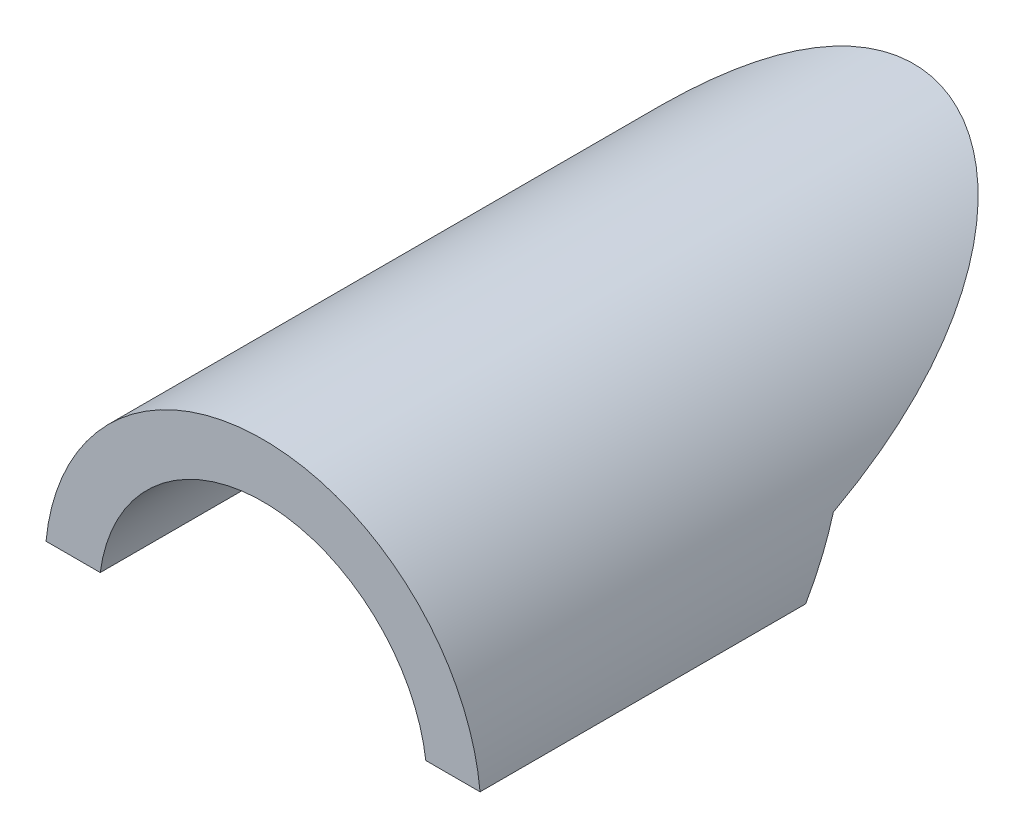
ISO-10303-21;
HEADER;
FILE_DESCRIPTION(('STEP AP214'),'2;1');
FILE_NAME('part.step','',(''),(''),'','','');
FILE_SCHEMA(('AUTOMOTIVE_DESIGN { 1 0 10303 214 1 1 1 1 }'));
ENDSEC;
DATA;
#1=APPLICATION_CONTEXT('core data for automotive mechanical design processes');
#2=APPLICATION_PROTOCOL_DEFINITION('international standard','automotive_design',2000,#1);
#3=PRODUCT_CONTEXT('',#1,'mechanical');
#4=PRODUCT('Part','Part','',(#3));
#5=PRODUCT_RELATED_PRODUCT_CATEGORY('part','',(#4));
#6=PRODUCT_DEFINITION_FORMATION('','',#4);
#7=PRODUCT_DEFINITION_CONTEXT('part definition',#1,'design');
#8=PRODUCT_DEFINITION('design','',#6,#7);
#9=PRODUCT_DEFINITION_SHAPE('','',#8);
#10=(LENGTH_UNIT() NAMED_UNIT(*) SI_UNIT(.MILLI.,.METRE.));
#11=(NAMED_UNIT(*) PLANE_ANGLE_UNIT() SI_UNIT($,.RADIAN.));
#12=(NAMED_UNIT(*) SI_UNIT($,.STERADIAN.) SOLID_ANGLE_UNIT());
#13=UNCERTAINTY_MEASURE_WITH_UNIT(LENGTH_MEASURE(1.E-05),#10,'distance_accuracy_value','');
#14=(GEOMETRIC_REPRESENTATION_CONTEXT(3) GLOBAL_UNCERTAINTY_ASSIGNED_CONTEXT((#13)) GLOBAL_UNIT_ASSIGNED_CONTEXT((#10,
#11,#12)) REPRESENTATION_CONTEXT('',''));
#15=CARTESIAN_POINT('',(0.,0.,0.));
#16=DIRECTION('',(0.,0.,1.));
#17=DIRECTION('',(1.,0.,0.));
#18=AXIS2_PLACEMENT_3D('',#15,#16,#17);
#19=CARTESIAN_POINT('',(101.6,-9.987425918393,304.8));
#20=DIRECTION('',(0.,0.,-1.));
#21=DIRECTION('',(-1.,0.,0.));
#22=AXIS2_PLACEMENT_3D('',#19,#20,#21);
#23=CYLINDRICAL_SURFACE('',#22,102.089708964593);
#24=CARTESIAN_POINT('',(197.497788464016,25.0257550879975,133.720245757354));
#25=CARTESIAN_POINT('',(197.293096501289,25.5863569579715,132.085642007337));
#26=CARTESIAN_POINT('',(197.080174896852,26.1542991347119,130.454575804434));
#27=CARTESIAN_POINT('',(196.636782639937,27.3046532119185,127.199914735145));
#28=CARTESIAN_POINT('',(196.406311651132,27.8870653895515,125.576320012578));
#29=CARTESIAN_POINT('',(195.926687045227,29.0662538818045,122.336712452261));
#30=CARTESIAN_POINT('',(195.677529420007,29.6630332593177,120.720701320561));
#31=CARTESIAN_POINT('',(195.159418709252,30.870564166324,117.497116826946));
#32=CARTESIAN_POINT('',(194.89046571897,31.481315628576,115.889543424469));
#33=CARTESIAN_POINT('',(194.049817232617,33.3391770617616,111.06707017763));
#34=CARTESIAN_POINT('',(193.446266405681,34.6070852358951,107.865626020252));
#35=CARTESIAN_POINT('',(192.143919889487,37.1952640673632,101.503633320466));
#36=CARTESIAN_POINT('',(191.445130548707,38.5155312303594,98.3430820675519));
#37=CARTESIAN_POINT('',(190.312148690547,40.5404898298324,93.6184673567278));
#38=CARTESIAN_POINT('',(189.917771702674,41.2270884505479,92.037015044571));
#39=CARTESIAN_POINT('',(189.09992919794,42.6121760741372,88.8869058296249));
#40=CARTESIAN_POINT('',(188.676464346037,43.3106648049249,87.3182486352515));
#41=CARTESIAN_POINT('',(187.798646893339,44.7189764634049,84.194477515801));
#42=CARTESIAN_POINT('',(187.34429062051,45.4288007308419,82.6393652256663));
#43=CARTESIAN_POINT('',(186.402900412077,46.8589428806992,79.5439708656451));
#44=CARTESIAN_POINT('',(185.915867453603,47.5792604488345,78.0036883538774));
#45=CARTESIAN_POINT('',(184.908020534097,49.0283344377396,74.9416857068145));
#46=CARTESIAN_POINT('',(184.387265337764,49.7570744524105,73.4199384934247));
#47=CARTESIAN_POINT('',(183.309182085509,51.2232451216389,70.393632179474));
#48=CARTESIAN_POINT('',(182.751853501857,51.9606759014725,68.8890733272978));
#49=CARTESIAN_POINT('',(181.598594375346,53.4429706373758,65.8989331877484));
#50=CARTESIAN_POINT('',(181.002671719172,54.1878330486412,64.4133480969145));
#51=CARTESIAN_POINT('',(179.769886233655,55.6838540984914,61.4625466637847));
#52=CARTESIAN_POINT('',(179.13302557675,56.4350124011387,59.9973292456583));
#53=CARTESIAN_POINT('',(177.92678877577,57.8153965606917,57.333758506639));
#54=CARTESIAN_POINT('',(177.364090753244,58.4438700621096,56.131989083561));
#55=CARTESIAN_POINT('',(176.207307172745,59.7032437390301,53.7449925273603));
#56=CARTESIAN_POINT('',(175.613222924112,60.334143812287,52.559764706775));
#57=CARTESIAN_POINT('',(174.392117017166,61.5974061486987,50.2070030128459));
#58=CARTESIAN_POINT('',(173.765092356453,62.2297685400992,49.0394707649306));
#59=CARTESIAN_POINT('',(172.476624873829,63.4947339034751,46.7236410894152));
#60=CARTESIAN_POINT('',(171.815181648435,64.1273368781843,45.5753438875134));
#61=CARTESIAN_POINT('',(170.456697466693,65.391112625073,43.3002294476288));
#62=CARTESIAN_POINT('',(169.75967636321,66.0222859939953,42.1734007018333));
#63=CARTESIAN_POINT('',(168.328126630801,67.2820692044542,39.942369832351));
#64=CARTESIAN_POINT('',(167.593598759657,67.9106790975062,38.8381672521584));
#65=CARTESIAN_POINT('',(166.085408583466,69.1637076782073,36.6543234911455));
#66=CARTESIAN_POINT('',(165.31174581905,69.7881263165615,35.5746825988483));
#67=CARTESIAN_POINT('',(163.723689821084,71.0309204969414,33.4421630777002));
#68=CARTESIAN_POINT('',(162.909296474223,71.6492960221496,32.3892845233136));
#69=CARTESIAN_POINT('',(161.226593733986,72.8864760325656,30.2982935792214));
#70=CARTESIAN_POINT('',(160.357692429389,73.5051670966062,29.2605896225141));
#71=CARTESIAN_POINT('',(158.574819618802,74.73181287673,27.2180019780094));
#72=CARTESIAN_POINT('',(157.660847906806,75.3397675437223,26.2131184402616));
#73=CARTESIAN_POINT('',(155.78612023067,76.5424163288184,24.239033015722));
#74=CARTESIAN_POINT('',(154.825351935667,77.1371068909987,23.2698406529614));
#75=CARTESIAN_POINT('',(152.856000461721,78.3100515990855,21.3709145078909));
#76=CARTESIAN_POINT('',(151.847419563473,78.8883065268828,20.44117884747));
#77=CARTESIAN_POINT('',(149.784046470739,80.0236248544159,18.6272946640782));
#78=CARTESIAN_POINT('',(148.729382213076,80.5807397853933,17.7430331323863));
#79=CARTESIAN_POINT('',(146.570629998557,81.6718005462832,16.0215832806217));
#80=CARTESIAN_POINT('',(145.466540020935,82.2057454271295,15.1843968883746));
#81=CARTESIAN_POINT('',(143.20936614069,83.2462189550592,13.5621038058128));
#82=CARTESIAN_POINT('',(142.056312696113,83.7527642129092,12.7769654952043));
#83=CARTESIAN_POINT('',(139.701099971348,84.7344958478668,11.2631541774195));
#84=CARTESIAN_POINT('',(138.498948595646,85.2096872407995,10.5344721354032));
#85=CARTESIAN_POINT('',(135.769602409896,86.2275360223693,8.98103131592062));
#86=CARTESIAN_POINT('',(134.230230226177,86.7612500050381,8.17165042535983));
#87=CARTESIAN_POINT('',(131.08266117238,87.7664005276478,6.65497957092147));
#88=CARTESIAN_POINT('',(129.474476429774,88.2378479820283,5.94767171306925));
#89=CARTESIAN_POINT('',(126.195054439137,89.109835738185,4.64495964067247));
#90=CARTESIAN_POINT('',(124.523843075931,89.5104047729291,4.04951007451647));
#91=CARTESIAN_POINT('',(121.976125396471,90.0519536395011,3.24720630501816));
#92=CARTESIAN_POINT('',(121.119929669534,90.2226082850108,2.99488384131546));
#93=CARTESIAN_POINT('',(119.395122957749,90.5432222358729,2.52157786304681));
#94=CARTESIAN_POINT('',(118.526513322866,90.6931837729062,2.30059096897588));
#95=CARTESIAN_POINT('',(116.771828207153,90.9725635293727,1.8894381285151));
#96=CARTESIAN_POINT('',(115.885671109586,91.1018218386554,1.69951187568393));
#97=CARTESIAN_POINT('',(114.103892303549,91.3376390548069,1.35339471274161));
#98=CARTESIAN_POINT('',(113.208271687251,91.4442005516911,1.19719995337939));
#99=CARTESIAN_POINT('',(111.409169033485,91.63396516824,0.919287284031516));
#100=CARTESIAN_POINT('',(110.505686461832,91.7171666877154,0.79757173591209));
#101=CARTESIAN_POINT('',(108.692801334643,91.8596532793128,0.589255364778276));
#102=CARTESIAN_POINT('',(107.783398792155,91.9189384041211,0.502654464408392));
#103=CARTESIAN_POINT('',(105.960985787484,92.0131754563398,0.365047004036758));
#104=CARTESIAN_POINT('',(105.047976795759,92.0481364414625,0.314027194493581));
#105=CARTESIAN_POINT('',(103.220044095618,92.0935222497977,0.247801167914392));
#106=CARTESIAN_POINT('',(102.305120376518,92.1039469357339,0.232595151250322));
#107=CARTESIAN_POINT('',(100.475490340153,92.1001884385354,0.238078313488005));
#108=CARTESIAN_POINT('',(99.5607840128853,92.0860067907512,0.258765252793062));
#109=CARTESIAN_POINT('',(97.7336066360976,92.0331356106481,0.33591966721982));
#110=CARTESIAN_POINT('',(96.8211355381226,91.9944466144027,0.392386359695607));
#111=CARTESIAN_POINT('',(95.0913210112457,91.8978993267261,0.533389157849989));
#112=CARTESIAN_POINT('',(94.2735719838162,91.8423394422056,0.614561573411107));
#113=CARTESIAN_POINT('',(92.6428749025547,91.7118744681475,0.805317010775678));
#114=CARTESIAN_POINT('',(91.8299272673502,91.6369677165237,0.914902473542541));
#115=CARTESIAN_POINT('',(90.2104290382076,91.4682242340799,1.16200635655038));
#116=CARTESIAN_POINT('',(89.4038772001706,91.3743912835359,1.29951919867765));
#117=CARTESIAN_POINT('',(87.798276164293,91.1682787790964,1.60193064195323));
#118=CARTESIAN_POINT('',(86.9992276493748,91.0559975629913,1.76683171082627));
#119=CARTESIAN_POINT('',(84.6149876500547,90.6922709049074,2.30173354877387));
#120=CARTESIAN_POINT('',(83.042666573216,90.4139387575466,2.71193834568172));
#121=CARTESIAN_POINT('',(79.9414202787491,89.790916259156,3.63346841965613));
#122=CARTESIAN_POINT('',(78.4125012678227,89.4462164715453,4.14480807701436));
#123=CARTESIAN_POINT('',(75.9516197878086,88.8328300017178,5.05863048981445));
#124=CARTESIAN_POINT('',(75.0046459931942,88.58204591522,5.43313724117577));
#125=CARTESIAN_POINT('',(73.1322917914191,88.0576843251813,6.21846092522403));
#126=CARTESIAN_POINT('',(72.2069125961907,87.7841055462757,6.62927988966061));
#127=CARTESIAN_POINT('',(69.4646822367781,86.9315775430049,7.91350804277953));
#128=CARTESIAN_POINT('',(67.6816216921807,86.3208072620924,8.83873213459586));
#129=CARTESIAN_POINT('',(64.2104990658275,85.02715991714,10.8129944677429));
#130=CARTESIAN_POINT('',(62.522558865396,84.3441934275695,11.8621864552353));
#131=CARTESIAN_POINT('',(59.2458008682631,82.9190990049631,14.0694778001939));
#132=CARTESIAN_POINT('',(57.6569891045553,82.1769674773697,15.227583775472));
#133=CARTESIAN_POINT('',(55.0120710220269,80.8607966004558,17.2998002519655));
#134=CARTESIAN_POINT('',(53.9319219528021,80.2982563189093,18.1908101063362));
#135=CARTESIAN_POINT('',(51.8219740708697,79.1523402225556,20.0179154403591));
#136=CARTESIAN_POINT('',(50.792175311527,78.5689643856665,20.9540109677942));
#137=CARTESIAN_POINT('',(48.7815396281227,77.3846571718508,22.8676077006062));
#138=CARTESIAN_POINT('',(47.8007224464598,76.7837188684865,23.8451253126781));
#139=CARTESIAN_POINT('',(45.8871670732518,75.5676674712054,25.8375597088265));
#140=CARTESIAN_POINT('',(44.9544277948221,74.9525546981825,26.8524756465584));
#141=CARTESIAN_POINT('',(43.1342091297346,73.7101005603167,28.9178879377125));
#142=CARTESIAN_POINT('',(42.2467955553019,73.0827431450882,29.9684325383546));
#143=CARTESIAN_POINT('',(40.5170057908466,71.8191976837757,32.1007532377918));
#144=CARTESIAN_POINT('',(39.6746293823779,71.183009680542,33.1825291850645));
#145=CARTESIAN_POINT('',(38.0332789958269,69.9041440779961,35.3745237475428));
#146=CARTESIAN_POINT('',(37.234300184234,69.2614672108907,36.4847391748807));
#147=CARTESIAN_POINT('',(35.6778707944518,67.9715570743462,38.7313619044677));
#148=CARTESIAN_POINT('',(34.9204226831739,67.3243235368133,39.8677707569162));
#149=CARTESIAN_POINT('',(32.9334025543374,65.5769619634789,42.9616721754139));
#150=CARTESIAN_POINT('',(31.7409826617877,64.4742498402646,44.9416720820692));
#151=CARTESIAN_POINT('',(29.4618896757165,62.268485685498,48.9615469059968));
#152=CARTESIAN_POINT('',(28.3752326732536,61.1654336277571,51.0014308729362));
#153=CARTESIAN_POINT('',(26.2990940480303,58.9645291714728,55.1346273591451));
#154=CARTESIAN_POINT('',(25.3096735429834,57.8666804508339,57.2279724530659));
#155=CARTESIAN_POINT('',(23.4212183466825,55.681983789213,61.4603824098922));
#156=CARTESIAN_POINT('',(22.5221796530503,54.5951353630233,63.5994452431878));
#157=CARTESIAN_POINT('',(20.8045912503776,52.4331046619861,67.9248736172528));
#158=CARTESIAN_POINT('',(19.9863052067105,51.357970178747,70.1113674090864));
#159=CARTESIAN_POINT('',(18.4267610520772,49.2262969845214,74.5205461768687));
#160=CARTESIAN_POINT('',(17.6855040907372,48.1697585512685,76.743231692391));
#161=CARTESIAN_POINT('',(16.2740756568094,46.0784821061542,81.2201093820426));
#162=CARTESIAN_POINT('',(15.6038799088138,45.0437367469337,83.4742904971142));
#163=CARTESIAN_POINT('',(14.3285613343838,42.9980202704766,88.0115627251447));
#164=CARTESIAN_POINT('',(13.7234371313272,41.9870486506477,90.2946532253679));
#165=CARTESIAN_POINT('',(12.7284568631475,40.2605968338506,94.2662543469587));
#166=CARTESIAN_POINT('',(12.3246242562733,39.5391063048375,95.9486794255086));
#167=CARTESIAN_POINT('',(11.5468604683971,38.1104154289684,99.326499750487));
#168=CARTESIAN_POINT('',(11.1729298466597,37.4032153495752,101.021895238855));
#169=CARTESIAN_POINT('',(10.4531754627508,36.0037055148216,104.424678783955));
#170=CARTESIAN_POINT('',(10.1073508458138,35.3113953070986,106.132066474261));
#171=CARTESIAN_POINT('',(9.44207824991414,33.9421256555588,109.5581011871));
#172=CARTESIAN_POINT('',(9.12263039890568,33.2651662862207,111.276748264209));
#173=CARTESIAN_POINT('',(8.51136840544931,31.9332990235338,114.708415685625));
#174=CARTESIAN_POINT('',(8.21932338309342,31.278243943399,116.421337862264));
#175=CARTESIAN_POINT('',(7.65803566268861,29.9839825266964,119.856880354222));
#176=CARTESIAN_POINT('',(7.38879305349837,29.3447762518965,121.579500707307));
#177=CARTESIAN_POINT('',(6.87174000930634,28.0826492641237,125.033538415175));
#178=CARTESIAN_POINT('',(6.62392577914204,27.4597256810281,126.764954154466));
#179=CARTESIAN_POINT('',(6.14835692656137,26.2303340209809,130.236321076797));
#180=CARTESIAN_POINT('',(5.92060187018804,25.6238655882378,131.976272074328));
#181=CARTESIAN_POINT('',(5.70221153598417,25.0257550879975,133.720245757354));
#182=B_SPLINE_CURVE_WITH_KNOTS('',3,(#24,#25,#26,#27,#28,#29,#30,#31,#32,#33,#34,#35,#36,#37,
#38,#39,#40,#41,#42,#43,#44,#45,#46,#47,#48,#49,#50,#51,#52,#53,#54,#55,#56,#57,#58,#59,#60,#61,
#62,#63,#64,#65,#66,#67,#68,#69,#70,#71,#72,#73,#74,#75,#76,#77,#78,#79,#80,#81,#82,#83,#84,#85,
#86,#87,#88,#89,#90,#91,#92,#93,#94,#95,#96,#97,#98,#99,#100,#101,#102,#103,#104,#105,#106,#107,
#108,#109,#110,#111,#112,#113,#114,#115,#116,#117,#118,#119,#120,#121,#122,#123,#124,#125,#126,
#127,#128,#129,#130,#131,#132,#133,#134,#135,#136,#137,#138,#139,#140,#141,#142,#143,#144,#145,
#146,#147,#148,#149,#150,#151,#152,#153,#154,#155,#156,#157,#158,#159,#160,#161,#162,#163,#164,
#165,#166,#167,#168,#169,#170,#171,#172,#173,#174,#175,#176,#177,#178,#179,#180,#181),
.UNSPECIFIED.,.F.,.F.,(4,2,2,2,2,2,2,2,2,2,2,2,2,2,2,2,2,2,2,2,2,2,2,2,2,2,2,2,2,2,2,2,2,2,2,2,
2,2,2,2,2,2,2,2,2,2,2,2,2,2,2,2,2,2,2,2,2,2,2,2,2,2,2,2,2,2,2,2,2,2,2,2,2,2,2,2,2,2,4),(0.,
5.2204082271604,10.4409165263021,15.6625477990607,20.8841539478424,31.3699166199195,
41.8549806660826,47.1605066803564,52.4659114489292,57.7719479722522,63.0778258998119,
68.3746943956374,73.6716393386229,78.9675052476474,84.2630903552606,88.66754542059,
93.0718168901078,97.4764904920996,101.881215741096,106.283509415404,110.685714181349,
115.087970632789,119.490239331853,123.953675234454,128.417131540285,132.881770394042,
137.346196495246,141.798931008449,146.251847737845,150.702033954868,155.151506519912,
160.604134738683,166.055805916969,171.505261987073,174.230859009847,176.956161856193,
179.701593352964,182.446711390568,185.192017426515,187.937317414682,190.681594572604,
193.425887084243,196.170008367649,198.91406962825,201.384276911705,203.854696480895,
206.324623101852,208.794772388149,213.734964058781,218.675858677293,221.821094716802,
224.966506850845,231.256948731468,237.555275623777,243.853985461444,248.379385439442,
252.904790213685,257.432004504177,261.9591164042,266.492624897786,271.026111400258,
275.559091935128,280.092341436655,287.771602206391,295.452029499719,303.137253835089,
310.822137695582,318.531336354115,326.240650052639,333.947321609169,341.653830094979,
347.277352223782,352.90097950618,358.524435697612,364.147919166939,369.718710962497,
375.289524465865,380.859349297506,386.429053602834),.UNSPECIFIED.);
#183=CARTESIAN_POINT('',(197.497788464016,25.0257550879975,133.720245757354));
#184=VERTEX_POINT('',#183);
#185=CARTESIAN_POINT('',(5.70221153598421,25.0257550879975,133.720245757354));
#186=VERTEX_POINT('',#185);
#187=EDGE_CURVE('E116',#184,#186,#182,.T.);
#188=ORIENTED_EDGE('',*,*,#187,.T.);
#189=CARTESIAN_POINT('',(101.6,-9.987425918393,159.85482647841));
#190=DIRECTION('',(0.,0.598162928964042,0.801374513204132));
#191=DIRECTION('',(0.,0.801374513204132,-0.598162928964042));
#192=AXIS2_PLACEMENT_3D('',#189,#190,#191);
#193=ELLIPSE('',#192,127.393256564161,102.089708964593);
#194=CARTESIAN_POINT('',(0.,0.,152.4));
#195=VERTEX_POINT('',#194);
#196=EDGE_CURVE('E101',#186,#195,#193,.T.);
#197=ORIENTED_EDGE('',*,*,#196,.T.);
#198=DIRECTION('',(0.,0.,-1.));
#199=VECTOR('',#198,1.);
#200=CARTESIAN_POINT('',(0.,0.,304.8));
#201=LINE('',#200,#199);
#202=CARTESIAN_POINT('',(0.,0.,304.8));
#203=VERTEX_POINT('',#202);
#204=EDGE_CURVE('E115',#203,#195,#201,.T.);
#205=ORIENTED_EDGE('',*,*,#204,.F.);
#206=CARTESIAN_POINT('',(101.6,-9.987425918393,304.8));
#207=DIRECTION('',(0.,0.,1.));
#208=DIRECTION('',(-1.,0.,0.));
#209=AXIS2_PLACEMENT_3D('',#206,#207,#208);
#210=CIRCLE('',#209,102.089708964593);
#211=CARTESIAN_POINT('',(203.2,0.,304.8));
#212=VERTEX_POINT('',#211);
#213=EDGE_CURVE('E134',#212,#203,#210,.T.);
#214=ORIENTED_EDGE('',*,*,#213,.F.);
#215=DIRECTION('',(0.,0.,-1.));
#216=VECTOR('',#215,1.);
#217=CARTESIAN_POINT('',(203.2,0.,304.8));
#218=LINE('',#217,#216);
#219=CARTESIAN_POINT('',(203.2,0.,152.4));
#220=VERTEX_POINT('',#219);
#221=EDGE_CURVE('E127',#212,#220,#218,.T.);
#222=ORIENTED_EDGE('',*,*,#221,.T.);
#223=EDGE_CURVE('E58',#220,#184,#193,.T.);
#224=ORIENTED_EDGE('',*,*,#223,.T.);
#225=EDGE_LOOP('',(#188,#197,#205,#214,#222,#224));
#226=FACE_BOUND('',#225,.T.);
#227=ADVANCED_FACE('F37',(#226),#23,.T.);
#228=CARTESIAN_POINT('',(0.,0.,304.8));
#229=DIRECTION('',(0.,1.,0.));
#230=DIRECTION('',(0.,0.,1.));
#231=AXIS2_PLACEMENT_3D('',#228,#229,#230);
#232=PLANE('',#231);
#233=ORIENTED_EDGE('',*,*,#204,.T.);
#234=DIRECTION('',(1.,0.,0.));
#235=VECTOR('',#234,1.);
#236=CARTESIAN_POINT('',(-25.4,0.,152.4));
#237=LINE('',#236,#235);
#238=CARTESIAN_POINT('',(25.4,0.,152.4));
#239=VERTEX_POINT('',#238);
#240=EDGE_CURVE('E97',#195,#239,#237,.T.);
#241=ORIENTED_EDGE('',*,*,#240,.T.);
#242=DIRECTION('',(0.,0.,-1.));
#243=VECTOR('',#242,1.);
#244=CARTESIAN_POINT('',(25.4,0.,304.8));
#245=LINE('',#244,#243);
#246=CARTESIAN_POINT('',(25.4,0.,304.8));
#247=VERTEX_POINT('',#246);
#248=EDGE_CURVE('E120',#247,#239,#245,.T.);
#249=ORIENTED_EDGE('',*,*,#248,.F.);
#250=DIRECTION('',(1.,0.,0.));
#251=VECTOR('',#250,1.);
#252=CARTESIAN_POINT('',(0.,0.,304.8));
#253=LINE('',#252,#251);
#254=EDGE_CURVE('E119',#203,#247,#253,.T.);
#255=ORIENTED_EDGE('',*,*,#254,.F.);
#256=EDGE_LOOP('',(#233,#241,#249,#255));
#257=FACE_BOUND('',#256,.T.);
#258=ADVANCED_FACE('F118',(#257),#232,.F.);
#259=CARTESIAN_POINT('',(101.6,-9.987425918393,304.8));
#260=DIRECTION('',(0.,0.,-1.));
#261=DIRECTION('',(-1.,0.,0.));
#262=AXIS2_PLACEMENT_3D('',#259,#260,#261);
#263=CYLINDRICAL_SURFACE('',#262,76.8517317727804);
#264=CARTESIAN_POINT('',(33.1875316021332,25.0257550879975,133.720245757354));
#265=CARTESIAN_POINT('',(33.3930249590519,25.4272544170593,132.549554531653));
#266=CARTESIAN_POINT('',(33.6048004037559,25.8323434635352,131.381189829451));
#267=CARTESIAN_POINT('',(34.0416151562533,26.6495535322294,129.049385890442));
#268=CARTESIAN_POINT('',(34.2666547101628,27.0616746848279,127.885946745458));
#269=CARTESIAN_POINT('',(34.7307387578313,27.8928742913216,125.564064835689));
#270=CARTESIAN_POINT('',(34.9697861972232,28.3119541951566,124.405623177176));
#271=CARTESIAN_POINT('',(35.4625868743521,29.1567989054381,122.094334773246));
#272=CARTESIAN_POINT('',(35.7163400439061,29.5825636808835,120.941488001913));
#273=CARTESIAN_POINT('',(36.5030071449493,30.8731801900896,117.482259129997));
#274=CARTESIAN_POINT('',(37.0594171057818,31.7479036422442,115.184824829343));
#275=CARTESIAN_POINT('',(38.2415609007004,33.5215691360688,110.617439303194));
#276=CARTESIAN_POINT('',(38.8672901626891,34.420509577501,108.347486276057));
#277=CARTESIAN_POINT('',(40.2033826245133,36.2504603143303,103.813684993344));
#278=CARTESIAN_POINT('',(40.914618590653,37.1817175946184,101.550192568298));
#279=CARTESIAN_POINT('',(42.4252146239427,39.0634655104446,97.0604047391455));
#280=CARTESIAN_POINT('',(43.2245823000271,40.0139578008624,94.8341125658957));
#281=CARTESIAN_POINT('',(44.4966935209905,41.4499957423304,91.5298788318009));
#282=CARTESIAN_POINT('',(44.9325186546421,41.9299924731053,90.4352212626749));
#283=CARTESIAN_POINT('',(45.8301288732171,42.8930396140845,88.2579767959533));
#284=CARTESIAN_POINT('',(46.291913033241,43.3760899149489,87.1753894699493));
#285=CARTESIAN_POINT('',(47.2428700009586,44.3444383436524,85.0236007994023));
#286=CARTESIAN_POINT('',(47.732037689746,44.8297360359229,83.954396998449));
#287=CARTESIAN_POINT('',(48.7394368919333,45.8018159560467,81.8305042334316));
#288=CARTESIAN_POINT('',(49.2576668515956,46.2885981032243,80.7758144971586));
#289=CARTESIAN_POINT('',(50.1939414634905,47.143152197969,78.9393144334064));
#290=CARTESIAN_POINT('',(50.6053547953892,47.5108081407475,78.1540674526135));
#291=CARTESIAN_POINT('',(51.4464808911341,48.2459414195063,76.5934093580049));
#292=CARTESIAN_POINT('',(51.8761929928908,48.6134187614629,75.8179978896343));
#293=CARTESIAN_POINT('',(53.1940978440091,49.7149147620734,73.5074844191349));
#294=CARTESIAN_POINT('',(54.1110393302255,50.4479791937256,71.9881424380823));
#295=CARTESIAN_POINT('',(56.0280825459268,51.9063464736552,68.9995778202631));
#296=CARTESIAN_POINT('',(57.0281601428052,52.6316515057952,67.5303408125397));
#297=CARTESIAN_POINT('',(59.1191301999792,54.0685946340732,64.6507287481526));
#298=CARTESIAN_POINT('',(60.2100202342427,54.7802330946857,63.2403521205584));
#299=CARTESIAN_POINT('',(62.503747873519,56.1904053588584,60.4738028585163));
#300=CARTESIAN_POINT('',(63.7077490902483,56.8886873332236,59.1184606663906));
#301=CARTESIAN_POINT('',(66.2246071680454,58.2534734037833,56.4946184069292));
#302=CARTESIAN_POINT('',(67.537484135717,58.9199715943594,55.2261344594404));
#303=CARTESIAN_POINT('',(70.2760551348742,60.2071732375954,52.7975624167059));
#304=CARTESIAN_POINT('',(71.7014865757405,60.8279771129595,51.6372350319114));
#305=CARTESIAN_POINT('',(73.9280942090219,61.7139806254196,49.9938992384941));
#306=CARTESIAN_POINT('',(74.6848638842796,62.0017230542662,49.4624194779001));
#307=CARTESIAN_POINT('',(76.2284444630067,62.5601214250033,48.4347837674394));
#308=CARTESIAN_POINT('',(77.0152612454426,62.8307739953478,47.9386347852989));
#309=CARTESIAN_POINT('',(78.8183698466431,63.4175797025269,46.8665437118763));
#310=CARTESIAN_POINT('',(79.8429909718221,63.7282671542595,46.301522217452));
#311=CARTESIAN_POINT('',(81.9366097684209,64.3141274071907,45.239956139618));
#312=CARTESIAN_POINT('',(83.0055934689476,64.5893112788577,44.743390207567));
#313=CARTESIAN_POINT('',(85.1847463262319,65.0990534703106,43.8264061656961));
#314=CARTESIAN_POINT('',(86.2948980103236,65.3336287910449,43.405956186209));
#315=CARTESIAN_POINT('',(88.5519654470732,65.7572479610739,42.6485425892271));
#316=CARTESIAN_POINT('',(89.6988818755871,65.9462909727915,42.3115805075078));
#317=CARTESIAN_POINT('',(92.0327404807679,66.27564941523,41.7255720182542));
#318=CARTESIAN_POINT('',(93.2199433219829,66.4155285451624,41.4773124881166));
#319=CARTESIAN_POINT('',(95.6158895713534,66.6404185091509,41.0786144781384));
#320=CARTESIAN_POINT('',(96.8246327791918,66.7254298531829,40.9281750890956));
#321=CARTESIAN_POINT('',(99.2525850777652,66.8380545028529,40.7289416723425));
#322=CARTESIAN_POINT('',(100.471788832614,66.8656955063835,40.6800985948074));
#323=CARTESIAN_POINT('',(102.909859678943,66.8628088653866,40.6852009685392));
#324=CARTESIAN_POINT('',(104.128726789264,66.8322857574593,40.7391384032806));
#325=CARTESIAN_POINT('',(106.420271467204,66.7205955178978,40.9367353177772));
#326=CARTESIAN_POINT('',(107.494180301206,66.6454158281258,41.0697890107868));
#327=CARTESIAN_POINT('',(109.625407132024,66.4516101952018,41.4133174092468));
#328=CARTESIAN_POINT('',(110.682726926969,66.3329889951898,41.6237836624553));
#329=CARTESIAN_POINT('',(112.774809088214,66.0548414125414,42.1183183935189));
#330=CARTESIAN_POINT('',(113.80956383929,65.8953014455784,42.4024113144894));
#331=CARTESIAN_POINT('',(115.851039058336,65.5385360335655,43.0393447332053));
#332=CARTESIAN_POINT('',(116.857755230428,65.3413048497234,43.3921957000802));
#333=CARTESIAN_POINT('',(119.162848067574,64.8426656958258,44.2869931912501));
#334=CARTESIAN_POINT('',(120.449096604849,64.5282717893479,44.8530605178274));
#335=CARTESIAN_POINT('',(122.95916225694,63.8479822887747,46.0839173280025));
#336=CARTESIAN_POINT('',(124.182961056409,63.4820717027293,46.7487355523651));
#337=CARTESIAN_POINT('',(126.566832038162,62.7065872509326,48.1655050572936));
#338=CARTESIAN_POINT('',(127.726806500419,62.2969491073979,48.9175847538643));
#339=CARTESIAN_POINT('',(129.980630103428,61.4421303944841,50.4965926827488));
#340=CARTESIAN_POINT('',(131.074476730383,60.9969484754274,51.3235237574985));
#341=CARTESIAN_POINT('',(132.946954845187,60.1862049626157,52.8394382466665));
#342=CARTESIAN_POINT('',(133.739129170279,59.8265991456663,53.5150146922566));
#343=CARTESIAN_POINT('',(135.286525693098,59.0932496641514,54.8999817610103));
#344=CARTESIAN_POINT('',(136.041746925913,58.7195056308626,55.6093732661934));
#345=CARTESIAN_POINT('',(137.516727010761,57.9600967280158,57.0587242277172));
#346=CARTESIAN_POINT('',(138.236468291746,57.5744261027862,57.7986985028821));
#347=CARTESIAN_POINT('',(139.641421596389,56.7934459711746,59.3057344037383));
#348=CARTESIAN_POINT('',(140.326634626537,56.3981367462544,60.0727952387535));
#349=CARTESIAN_POINT('',(141.665171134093,55.5990010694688,61.632656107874));
#350=CARTESIAN_POINT('',(142.318435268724,55.1951606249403,62.4254998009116));
#351=CARTESIAN_POINT('',(143.59321456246,54.3812811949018,64.0331728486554));
#352=CARTESIAN_POINT('',(144.214729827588,53.9712422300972,64.8480021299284));
#353=CARTESIAN_POINT('',(145.427368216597,53.1464642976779,66.4973644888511));
#354=CARTESIAN_POINT('',(146.018496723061,52.7317261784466,67.3318940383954));
#355=CARTESIAN_POINT('',(147.171925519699,51.8987132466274,69.0189452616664));
#356=CARTESIAN_POINT('',(147.734224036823,51.4804382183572,69.8714680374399));
#357=CARTESIAN_POINT('',(149.292485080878,50.2888735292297,72.3162654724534));
#358=CARTESIAN_POINT('',(150.255730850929,49.5126674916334,73.9280708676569));
#359=CARTESIAN_POINT('',(152.097481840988,47.9577663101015,77.1983235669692));
#360=CARTESIAN_POINT('',(152.975971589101,47.1790707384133,78.8567793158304));
#361=CARTESIAN_POINT('',(154.656190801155,45.6231946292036,82.2145430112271));
#362=CARTESIAN_POINT('',(155.45786181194,44.8460156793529,83.9138808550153));
#363=CARTESIAN_POINT('',(156.99042520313,43.2974310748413,87.3464980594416));
#364=CARTESIAN_POINT('',(157.721321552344,42.5260250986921,89.079775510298));
#365=CARTESIAN_POINT('',(159.120029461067,40.9901760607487,92.5796135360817));
#366=CARTESIAN_POINT('',(159.787701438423,40.2257516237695,94.3462378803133));
#367=CARTESIAN_POINT('',(161.063746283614,38.707897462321,97.9054113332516));
#368=CARTESIAN_POINT('',(161.672117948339,37.9544679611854,99.6979609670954));
#369=CARTESIAN_POINT('',(162.834311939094,36.4608532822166,103.305068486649));
#370=CARTESIAN_POINT('',(163.388157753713,35.7206625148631,105.119616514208));
#371=CARTESIAN_POINT('',(164.446107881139,34.2547748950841,108.768833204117));
#372=CARTESIAN_POINT('',(164.950213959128,33.5290775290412,110.603501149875));
#373=CARTESIAN_POINT('',(165.88832216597,32.129946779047,114.197051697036));
#374=CARTESIAN_POINT('',(166.32458592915,31.4557325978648,115.955042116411));
#375=CARTESIAN_POINT('',(167.159176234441,30.1224413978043,119.485537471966));
#376=CARTESIAN_POINT('',(167.557505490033,29.4633632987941,121.258041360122));
#377=CARTESIAN_POINT('',(168.316845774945,28.165078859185,124.805330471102));
#378=CARTESIAN_POINT('',(168.678071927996,27.5257749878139,126.580034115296));
#379=CARTESIAN_POINT('',(169.368581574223,26.2634209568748,130.141434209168));
#380=CARTESIAN_POINT('',(169.697864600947,25.6403710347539,131.928130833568));
#381=CARTESIAN_POINT('',(170.012468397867,25.0257550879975,133.720245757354));
#382=B_SPLINE_CURVE_WITH_KNOTS('',3,(#264,#265,#266,#267,#268,#269,#270,#271,#272,#273,#274,
#275,#276,#277,#278,#279,#280,#281,#282,#283,#284,#285,#286,#287,#288,#289,#290,#291,#292,#293,
#294,#295,#296,#297,#298,#299,#300,#301,#302,#303,#304,#305,#306,#307,#308,#309,#310,#311,#312,
#313,#314,#315,#316,#317,#318,#319,#320,#321,#322,#323,#324,#325,#326,#327,#328,#329,#330,#331,
#332,#333,#334,#335,#336,#337,#338,#339,#340,#341,#342,#343,#344,#345,#346,#347,#348,#349,#350,
#351,#352,#353,#354,#355,#356,#357,#358,#359,#360,#361,#362,#363,#364,#365,#366,#367,#368,#369,
#370,#371,#372,#373,#374,#375,#376,#377,#378,#379,#380,#381),.UNSPECIFIED.,.F.,.F.,(4,2,2,2,2,2,
2,2,2,2,2,2,2,2,2,2,2,2,2,2,2,2,2,2,2,2,2,2,2,2,2,2,2,2,2,2,2,2,2,2,2,2,2,2,2,2,2,2,2,2,2,2,2,2,
2,2,2,2,4),(0.,3.76369784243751,7.52746554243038,11.29202756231,15.0565721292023,
22.6168877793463,30.1767050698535,37.8215519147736,45.4670593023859,49.2835377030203,
53.0998802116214,56.9155116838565,60.7309393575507,63.6098535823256,66.4886637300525,
72.2464262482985,78.002523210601,83.7584664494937,89.5819645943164,95.4065405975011,
101.217908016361,104.122313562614,107.027290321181,110.656080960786,114.283737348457,
117.909871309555,121.536071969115,125.193685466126,128.851264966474,132.507078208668,
136.162606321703,139.413015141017,142.663069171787,145.914203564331,149.165833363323,
153.479449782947,157.794324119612,162.115630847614,166.437101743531,169.740319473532,
173.043623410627,176.348547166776,179.653374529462,182.96412378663,186.274861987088,
189.585011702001,192.89536474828,198.987946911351,205.081639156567,211.179932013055,
217.277882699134,223.388996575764,229.500234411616,235.608828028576,241.717204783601,
247.514864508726,253.312109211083,259.073578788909,264.835132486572),.UNSPECIFIED.);
#383=CARTESIAN_POINT('',(33.1875316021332,25.0257550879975,133.720245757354));
#384=VERTEX_POINT('',#383);
#385=CARTESIAN_POINT('',(170.012468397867,25.0257550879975,133.720245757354));
#386=VERTEX_POINT('',#385);
#387=EDGE_CURVE('E11',#384,#386,#382,.T.);
#388=ORIENTED_EDGE('',*,*,#387,.T.);
#389=CARTESIAN_POINT('',(101.6,-9.987425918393,159.85482647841));
#390=DIRECTION('',(0.,0.598162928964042,0.801374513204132));
#391=DIRECTION('',(0.,0.801374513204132,-0.598162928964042));
#392=AXIS2_PLACEMENT_3D('',#389,#390,#391);
#393=ELLIPSE('',#392,95.899895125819,76.8517317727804);
#394=CARTESIAN_POINT('',(177.8,0.,152.4));
#395=VERTEX_POINT('',#394);
#396=EDGE_CURVE('E210',#386,#395,#393,.F.);
#397=ORIENTED_EDGE('',*,*,#396,.T.);
#398=DIRECTION('',(0.,0.,-1.));
#399=VECTOR('',#398,1.);
#400=CARTESIAN_POINT('',(177.8,0.,304.8));
#401=LINE('',#400,#399);
#402=CARTESIAN_POINT('',(177.8,0.,304.8));
#403=VERTEX_POINT('',#402);
#404=EDGE_CURVE('E122',#403,#395,#401,.T.);
#405=ORIENTED_EDGE('',*,*,#404,.F.);
#406=CARTESIAN_POINT('',(101.6,-9.987425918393,304.8));
#407=DIRECTION('',(0.,0.,-1.));
#408=DIRECTION('',(-1.,0.,0.));
#409=AXIS2_PLACEMENT_3D('',#406,#407,#408);
#410=CIRCLE('',#409,76.8517317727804);
#411=EDGE_CURVE('E131',#247,#403,#410,.T.);
#412=ORIENTED_EDGE('',*,*,#411,.F.);
#413=ORIENTED_EDGE('',*,*,#248,.T.);
#414=EDGE_CURVE('E104',#239,#384,#393,.F.);
#415=ORIENTED_EDGE('',*,*,#414,.T.);
#416=EDGE_LOOP('',(#388,#397,#405,#412,#413,#415));
#417=FACE_BOUND('',#416,.T.);
#418=ADVANCED_FACE('F155',(#417),#263,.F.);
#419=CARTESIAN_POINT('',(177.8,0.,304.8));
#420=DIRECTION('',(0.,1.,0.));
#421=DIRECTION('',(0.,0.,1.));
#422=AXIS2_PLACEMENT_3D('',#419,#420,#421);
#423=PLANE('',#422);
#424=ORIENTED_EDGE('',*,*,#404,.T.);
#425=DIRECTION('',(1.,0.,0.));
#426=VECTOR('',#425,1.);
#427=CARTESIAN_POINT('',(177.8,0.,152.4));
#428=LINE('',#427,#426);
#429=EDGE_CURVE('E51',#395,#220,#428,.T.);
#430=ORIENTED_EDGE('',*,*,#429,.T.);
#431=ORIENTED_EDGE('',*,*,#221,.F.);
#432=DIRECTION('',(1.,0.,0.));
#433=VECTOR('',#432,1.);
#434=CARTESIAN_POINT('',(177.8,0.,304.8));
#435=LINE('',#434,#433);
#436=EDGE_CURVE('E66',#403,#212,#435,.T.);
#437=ORIENTED_EDGE('',*,*,#436,.F.);
#438=EDGE_LOOP('',(#424,#430,#431,#437));
#439=FACE_BOUND('',#438,.T.);
#440=ADVANCED_FACE('F153',(#439),#423,.F.);
#441=CARTESIAN_POINT('',(101.6,-9.987425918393,304.8));
#442=DIRECTION('',(0.,0.,-1.));
#443=DIRECTION('',(-1.,0.,0.));
#444=AXIS2_PLACEMENT_3D('',#441,#442,#443);
#445=PLANE('',#444);
#446=ORIENTED_EDGE('',*,*,#213,.T.);
#447=ORIENTED_EDGE('',*,*,#254,.T.);
#448=ORIENTED_EDGE('',*,*,#411,.T.);
#449=ORIENTED_EDGE('',*,*,#436,.T.);
#450=EDGE_LOOP('',(#446,#447,#448,#449));
#451=FACE_BOUND('',#450,.T.);
#452=ADVANCED_FACE('F145',(#451),#445,.F.);
#453=CARTESIAN_POINT('',(-25.4,549.00116589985,313.423047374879));
#454=DIRECTION('',(1.,0.,0.));
#455=DIRECTION('',(0.,0.,-1.));
#456=AXIS2_PLACEMENT_3D('',#453,#454,#455);
#457=CYLINDRICAL_SURFACE('',#456,553.934407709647);
#458=DIRECTION('',(1.,0.,0.));
#459=VECTOR('',#458,1.);
#460=CARTESIAN_POINT('',(-25.4,25.0257550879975,133.720245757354));
#461=LINE('',#460,#459);
#462=EDGE_CURVE('E109',#386,#184,#461,.T.);
#463=ORIENTED_EDGE('',*,*,#462,.F.);
#464=ORIENTED_EDGE('',*,*,#387,.F.);
#465=EDGE_CURVE('E214',#186,#384,#461,.T.);
#466=ORIENTED_EDGE('',*,*,#465,.F.);
#467=ORIENTED_EDGE('',*,*,#187,.F.);
#468=EDGE_LOOP('',(#463,#464,#466,#467));
#469=FACE_BOUND('',#468,.T.);
#470=ADVANCED_FACE('F141',(#469),#457,.T.);
#471=CARTESIAN_POINT('',(-25.4,0.,152.4));
#472=DIRECTION('',(0.,0.598162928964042,0.801374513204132));
#473=DIRECTION('',(0.,-0.801374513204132,0.598162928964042));
#474=AXIS2_PLACEMENT_3D('',#471,#472,#473);
#475=PLANE('',#474);
#476=ORIENTED_EDGE('',*,*,#465,.T.);
#477=ORIENTED_EDGE('',*,*,#414,.F.);
#478=ORIENTED_EDGE('',*,*,#240,.F.);
#479=ORIENTED_EDGE('',*,*,#196,.F.);
#480=EDGE_LOOP('',(#476,#477,#478,#479));
#481=FACE_BOUND('',#480,.T.);
#482=ADVANCED_FACE('F100',(#481),#475,.F.);
#483=ORIENTED_EDGE('',*,*,#429,.F.);
#484=ORIENTED_EDGE('',*,*,#396,.F.);
#485=ORIENTED_EDGE('',*,*,#462,.T.);
#486=ORIENTED_EDGE('',*,*,#223,.F.);
#487=EDGE_LOOP('',(#483,#484,#485,#486));
#488=FACE_BOUND('',#487,.T.);
#489=ADVANCED_FACE('F150',(#488),#475,.F.);
#490=CLOSED_SHELL('',(#227,#258,#418,#440,#452,#470,#482,#489));
#491=MANIFOLD_SOLID_BREP('B2',#490);
#492=ADVANCED_BREP_SHAPE_REPRESENTATION('',(#18,#491),#14);
#493=SHAPE_DEFINITION_REPRESENTATION(#9,#492);
ENDSEC;
END-ISO-10303-21;
